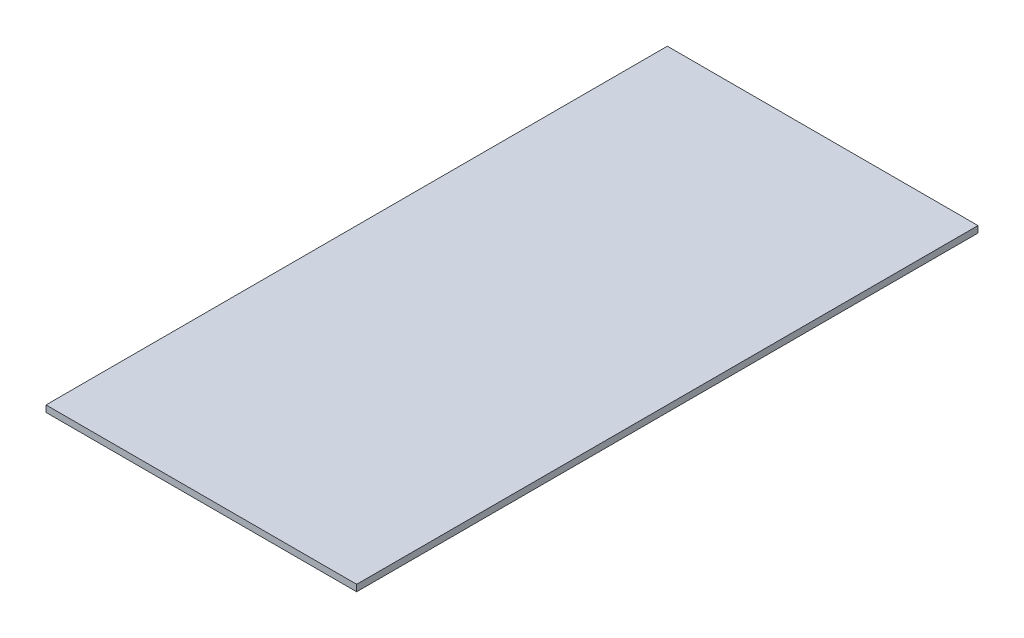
from build123d import *

# Parameters (mm, degrees)
SKETCH1_W           = 76.2
SKETCH1_H           = 152.4
BOSS_EXTRUDE1_DEPTH = 0.8001


with BuildPart() as part:
    # Sketch1 → Boss-Extrude1 (new, symmetric)
    with BuildSketch(Plane(origin=(0, 0, 0), x_dir=(1, 0, 0), z_dir=(0, 1, 0))):
        with Locations((38.1, 0)):
            Rectangle(SKETCH1_W, SKETCH1_H)
    extrude(amount=BOSS_EXTRUDE1_DEPTH, both=True)


solid = part.part
